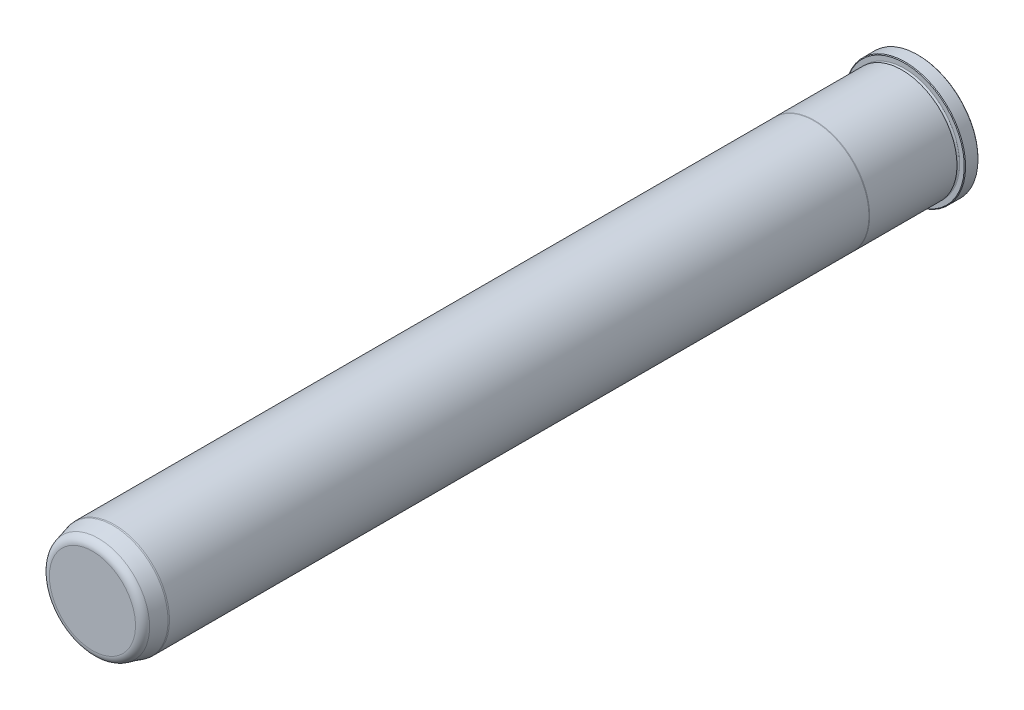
from build123d import *

# Parameters (mm, degrees)
FILLET6_R     = 4.7625
CHAMFER1_SIZE = 0.381


with BuildPart() as part:
    # Sketch1 → Revolve1 (revolve)
    with BuildSketch(Plane(origin=(0, 0, 0), x_dir=(0, 0, -1), z_dir=(1, 0, 0)), mode=Mode.PRIVATE) as revolve1_sk:
        with BuildLine():
            Line((0, 0), (0, 34.798))
            Line((0, 34.798), (-7.9248, 34.798))
            Line((-7.9248, 34.798), (-7.9248, 31.7373))
            ThreePointArc((-7.9248, 31.7373), (-8.6868, 30.9753), (-9.4488, 31.7373))
            Line((-9.4488, 31.7373), (-9.4488, 31.7627))
            Line((-9.4488, 31.7627), (-59.834763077, 31.7627))
            Line((-59.834763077, 31.7627), (-60.198, 31.7373))
            Line((-60.198, 31.7373), (-463.55, 31.7373))
            Line((-463.55, 31.7373), (-464.312, 31.670633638))
            Line((-464.312, 31.670633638), (-476.25, 28.471856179))
            Line((-476.25, 28.471856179), (-476.25, 0))
            Line((-476.25, 0), (0, 0))
        make_face()
    revolve(revolve1_sk.sketch.rotate(Axis((0, 0, 0), (0, 0, -1)), 90), axis=Axis((0, 0, 0), (0, 0, -1)))

    # Fillet6
    fillet6_edges = [part.edges().sort_by_distance(p)[0] for p in [
        (-28.471856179, 0, 476.25),
    ]]
    fillet(fillet6_edges, radius=FILLET6_R)

    # Chamfer1
    chamfer1_edges = [part.edges().sort_by_distance(p)[0] for p in [
        (-34.798, 0, 7.9248),
        (-34.798, 0, 0),
    ]]
    chamfer(chamfer1_edges, length=CHAMFER1_SIZE)


solid = part.part
